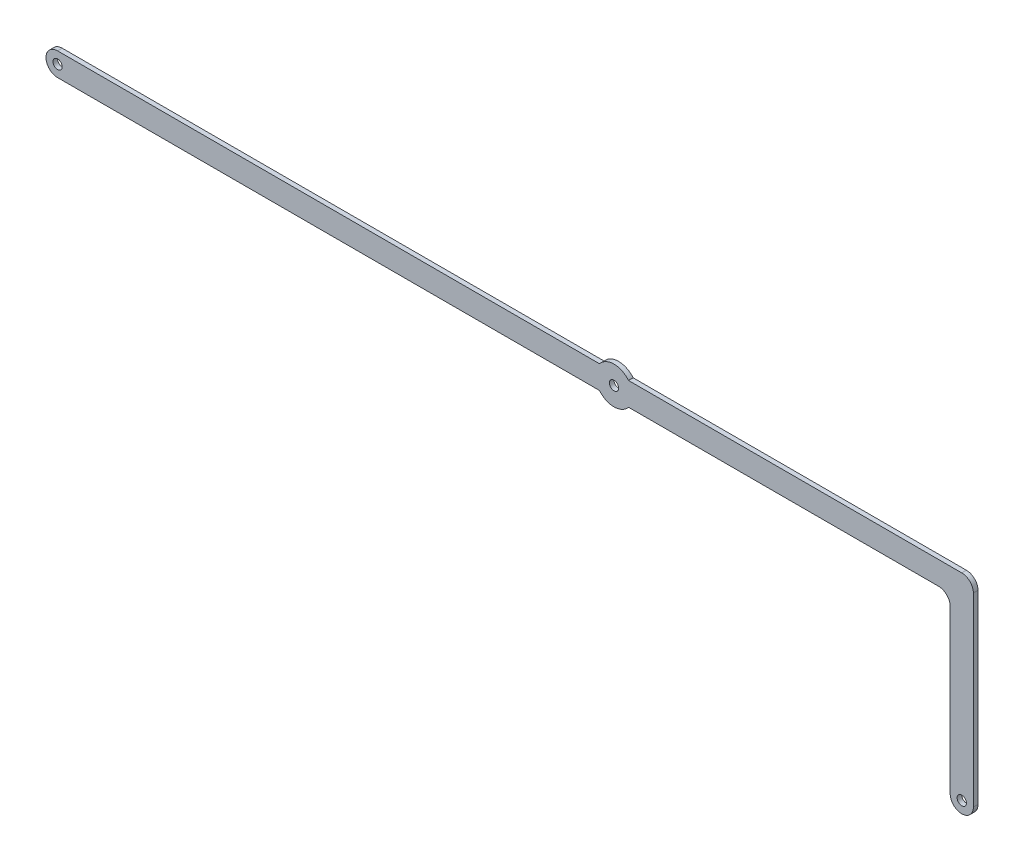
from build123d import *

# Parameters (mm, degrees)
SKETCH1_R      = 1
EXTRUDE1_DEPTH = 1


with BuildPart() as part:
    # Sketch1 → Extrude1 (new body)
    with BuildSketch(Plane.XY):
        with BuildLine():
            Line((0, -2.5), (116.877501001, -2.5))
            ThreePointArc((116.877501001, -2.5), (120, -4), (123.122498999, -2.5))
            Line((123.122498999, -2.5), (190, -2.5))
            ThreePointArc((190, -2.5), (191.767766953, -3.232233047), (192.5, -5))
            Line((192.5, -5), (192.5, -40))
            ThreePointArc((192.5, -40), (195, -42.5), (197.5, -40))
            Line((197.5, -40), (197.5, 0))
            ThreePointArc((197.5, 0), (196.767766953, 1.767766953), (195, 2.5))
            Line((195, 2.5), (123.122498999, 2.5))
            ThreePointArc((123.122498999, 2.5), (120, 4), (116.877501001, 2.5))
            Line((116.877501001, 2.5), (0, 2.5))
            ThreePointArc((0, 2.5), (-2.5, 0), (0, -2.5))
        make_face()
        Circle(SKETCH1_R, mode=Mode.SUBTRACT)
        with Locations((120, 0)):
            Circle(SKETCH1_R, mode=Mode.SUBTRACT)
        with Locations((195, -40)):
            Circle(SKETCH1_R, mode=Mode.SUBTRACT)
    extrude(amount=EXTRUDE1_DEPTH)


solid = part.part
